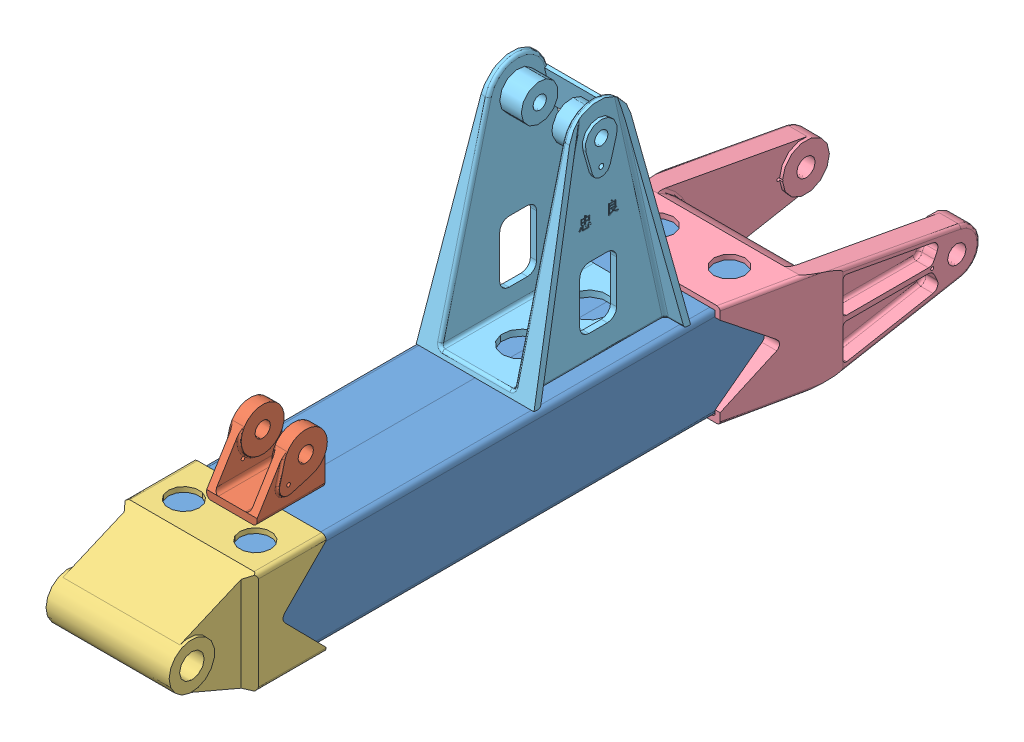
SolidWorks assembly ZLJX-XS-03-10A.SLDASM, configuration 默认 (file format 17000). Lengths in mm.
Overall size (285 520.32 1275).
6 component instances, 5 part files, 15 mates.
Components (placement in the parent):
- ZLJX-XS-03-10A-001-1: ZLJX-XS-03-10A-001.SLDPRT [默认] at (-90.5393 75.8989 0) size (100 150 830)
- ZLJX-XS-03-10A-001-2: ZLJX-XS-03-10A-001.SLDPRT [默认] at (93.4607 -58.1011 0) x (-1 0 0) z (0 0 1) size (100 150 830)
- ZLJX-Z-009-1: ZLJX-Z-009.SLDPRT [默认] at (1.4607 91.8989 725) x (-1 0 0) z (0 1 0) size (90 110 102)
- ZLJX-Z-003-1: ZLJX-Z-003.SLDPRT [默认] at (1.4607 8.8989 735) x (0 -1 0) z (0 0 1) size (166 216 247)
- ZLJX-Z-002-1: ZLJX-Z-002.SLDPRT [默认] at (1.4607 8.8989 -255) x (0 0 -1) z (1 0 0) size (388 170.64 285)
- ZLJX-Z-019-1: ZLJX-Z-019.SLDPRT [默认] at (1.4607 83.8989 255) x (0 0 -1) z (1 0 0) size (250 360 200)
Mates (geometry in assembly coordinates):
- 重合1: coincident aligned: plane of ZLJX-XS-03-10A-001-1 through (1.4607 83.8989 830) normal (0 1 0); plane of ZLJX-XS-03-10A-001-2 through (93.4607 83.8989 830) normal (0 1 0)
- 重合2: coincident anti-aligned: plane of ZLJX-XS-03-10A-001-1 through (1.4607 83.8989 830) normal (1 0 0); plane of ZLJX-XS-03-10A-001-2 through (1.4607 75.8989 830) normal (-1 0 0)
- 重合3: coincident aligned: plane of ZLJX-XS-03-10A-001-1 through (-89.8027 -57.3645 830) normal (0 0 1); plane of ZLJX-XS-03-10A-001-2 through (101.4607 75.1623 830) normal (0 0 1)
- 重合6: coincident anti-aligned: plane of ZLJX-XS-03-10A-001-1 through (1.4607 83.8989 830) normal (0 1 0); plane of ZLJX-Z-002-1 through (-98.5393 83.8989 95) normal (0 -1 0)
- 重合7: coincident anti-aligned: plane of ZLJX-XS-03-10A-001-1 through (-98.5393 75.8989 830) normal (-1 0 0); plane of ZLJX-Z-002-1 through (-98.5393 8.8989 19.8462) normal (1 0 0)
- 重合8: coincident anti-aligned: plane of ZLJX-XS-03-10A-001-2; plane of ZLJX-Z-003-1 through (101.4607 -66.1011 845) normal (0 1 0)
- 重合9: coincident anti-aligned: plane of ZLJX-XS-03-10A-001-1 through (-98.5393 75.8989 830) normal (-1 0 0); plane of ZLJX-Z-003-1 through (-98.5393 83.8989 845) normal (1 0 0)
- 距离2: distance = 1165 mm: cylinder of ZLJX-Z-003-1 through (109.4607 8.8989 945) axis (-1 0 0) radius 20; cylinder of ZLJX-Z-002-1 through (-141.0393 8.8989 -255) axis (1 0 0) radius 15
- 距离3: distance = 95 mm anti-aligned: plane of ZLJX-XS-03-10A-001-2 through (101.4607 75.1623 830) normal (0 0 1); plane of ZLJX-Z-003-1 through (109.4607 91.8989 735) normal (0 0 -1)
- 重合14: coincident anti-aligned: plane of ZLJX-Z-009-1; plane of ZLJX-Z-003-1 through (109.4607 91.8989 845) normal (0 1 0)
- 距离6: distance = 59 mm aligned: plane of ZLJX-XS-03-10A-001-1 through (-98.5393 75.8989 830) normal (-1 0 0); plane of ZLJX-Z-009-1
- 距离7: distance = 65 mm aligned: plane of ZLJX-Z-009-1 through (42.4607 103.8989 670) normal (0 0 -1); plane of ZLJX-Z-003-1 through (109.4607 91.8989 735) normal (0 0 -1)
- 重合15: coincident anti-aligned: plane of ZLJX-XS-03-10A-001-1 through (1.4607 83.8989 830) normal (0 1 0); plane of ZLJX-Z-019-1 through (71.4607 83.8989 385) normal (0 -1 0)
- 距离11: distance = 30 mm aligned: plane of ZLJX-XS-03-10A-001-2; plane of ZLJX-Z-019-1 through (71.4607 393.8989 255) normal (1 0 0)
- 距离12: distance = 40 mm: plane of ZLJX-Z-002-1 through (143.9607 91.8989 95) normal (0 0 1); line of ZLJX-Z-019-1 through (101.4607 83.8989 135) axis (-1 0 0)
